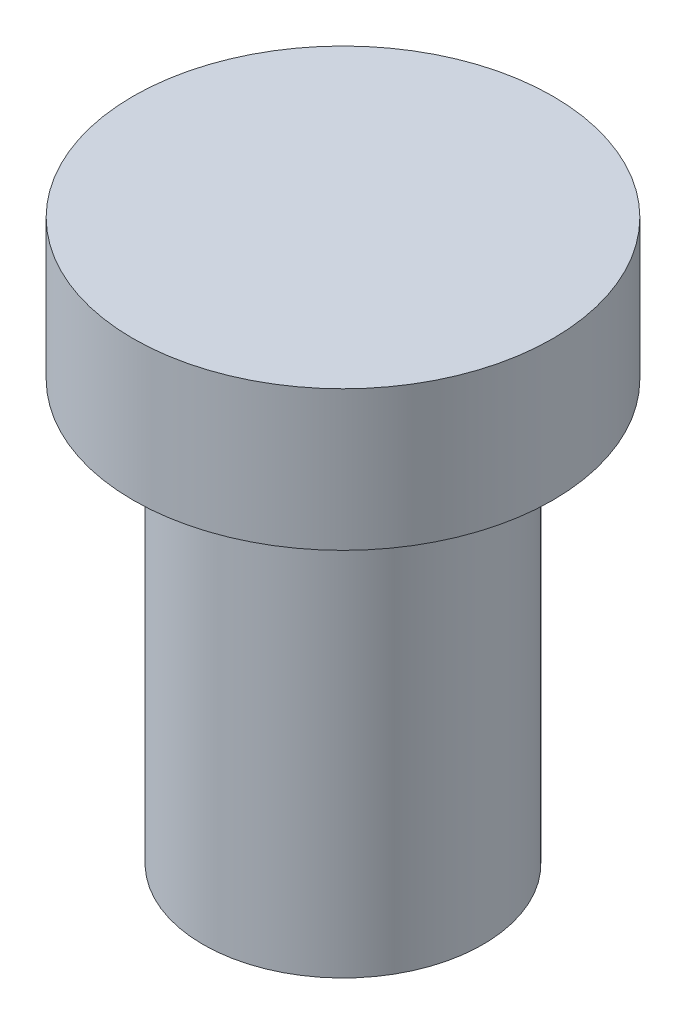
from build123d import *


with BuildPart() as part:
    # Sketch1 → Revolve1 (revolve)
    with BuildSketch(Plane.XY, mode=Mode.PRIVATE) as revolve1_sk:
        Polygon((0, 0), (7.5, 0), (7.5, -5), (5, -5), (5, -20), (0, -20), align=None)
    revolve(revolve1_sk.sketch.rotate(Axis((0, 22.254752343, 0), (0, -1, 0)), 90), axis=Axis((0, 22.254752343, 0), (0, -1, 0)))


solid = part.part
